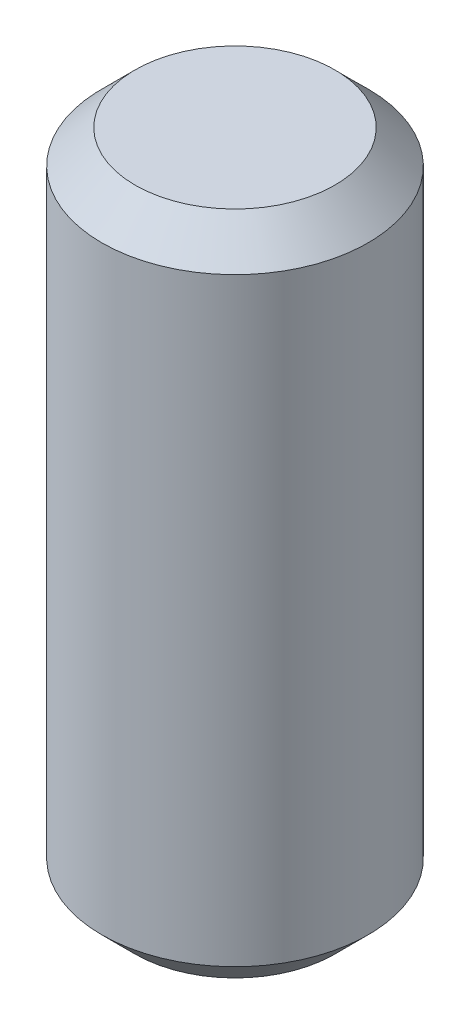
from build123d import *


with BuildPart() as part:
    # Esquisse1 → R_volution1 (revolve)
    with BuildSketch(Plane.XY, mode=Mode.PRIVATE) as r_volution1_sk:
        Polygon((3, 20), (0, 20), (0, 0), (3, 0), (4, 1), (4, 19), align=None)
    revolve(r_volution1_sk.sketch.rotate(Axis((0, 32.809210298, 0), (0, -1, 0)), 90), axis=Axis((0, 32.809210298, 0), (0, -1, 0)))


solid = part.part
